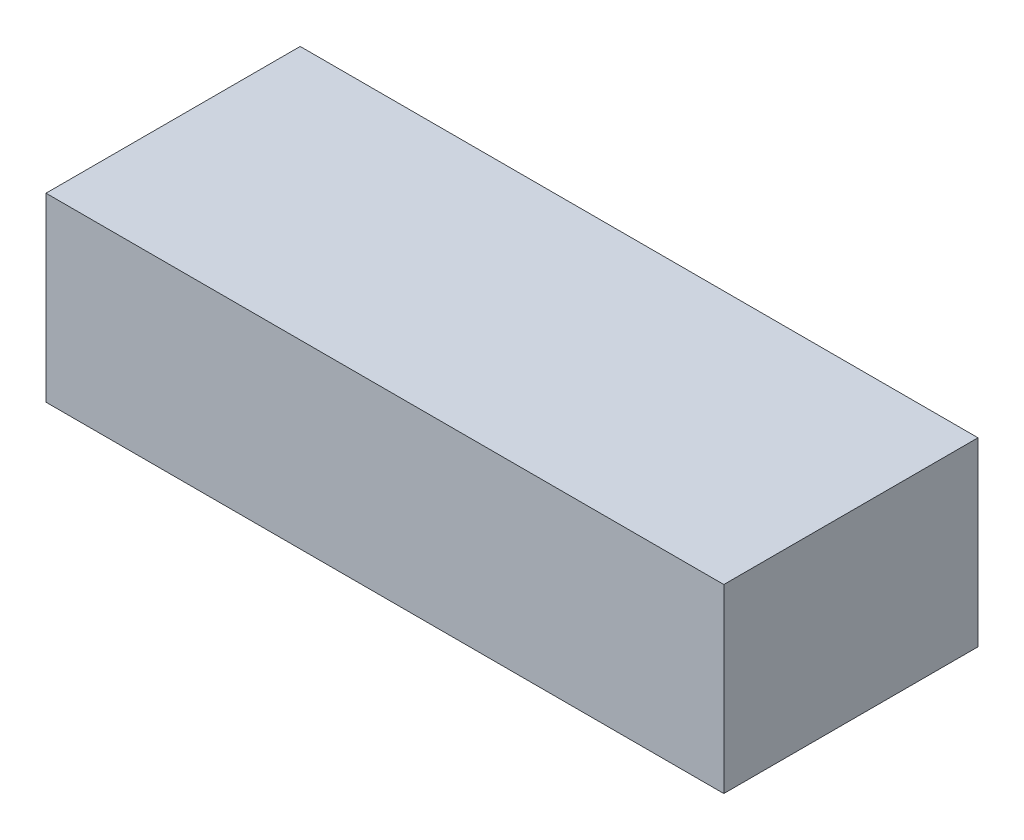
ISO-10303-21;
HEADER;
FILE_DESCRIPTION(('STEP AP214'),'2;1');
FILE_NAME('part.step','',(''),(''),'','','');
FILE_SCHEMA(('AUTOMOTIVE_DESIGN { 1 0 10303 214 1 1 1 1 }'));
ENDSEC;
DATA;
#1=APPLICATION_CONTEXT('core data for automotive mechanical design processes');
#2=APPLICATION_PROTOCOL_DEFINITION('international standard','automotive_design',2000,#1);
#3=PRODUCT_CONTEXT('',#1,'mechanical');
#4=PRODUCT('Part','Part','',(#3));
#5=PRODUCT_RELATED_PRODUCT_CATEGORY('part','',(#4));
#6=PRODUCT_DEFINITION_FORMATION('','',#4);
#7=PRODUCT_DEFINITION_CONTEXT('part definition',#1,'design');
#8=PRODUCT_DEFINITION('design','',#6,#7);
#9=PRODUCT_DEFINITION_SHAPE('','',#8);
#10=(LENGTH_UNIT() NAMED_UNIT(*) SI_UNIT(.MILLI.,.METRE.));
#11=(NAMED_UNIT(*) PLANE_ANGLE_UNIT() SI_UNIT($,.RADIAN.));
#12=(NAMED_UNIT(*) SI_UNIT($,.STERADIAN.) SOLID_ANGLE_UNIT());
#13=UNCERTAINTY_MEASURE_WITH_UNIT(LENGTH_MEASURE(1.E-05),#10,'distance_accuracy_value','');
#14=(GEOMETRIC_REPRESENTATION_CONTEXT(3) GLOBAL_UNCERTAINTY_ASSIGNED_CONTEXT((#13)) GLOBAL_UNIT_ASSIGNED_CONTEXT((#10,
#11,#12)) REPRESENTATION_CONTEXT('',''));
#15=CARTESIAN_POINT('',(0.,0.,0.));
#16=DIRECTION('',(0.,0.,1.));
#17=DIRECTION('',(1.,0.,0.));
#18=AXIS2_PLACEMENT_3D('',#15,#16,#17);
#19=CARTESIAN_POINT('',(-200.,-53.41880342,75.));
#20=DIRECTION('',(1.,0.,0.));
#21=DIRECTION('',(0.,0.,-1.));
#22=AXIS2_PLACEMENT_3D('',#19,#20,#21);
#23=PLANE('',#22);
#24=DIRECTION('',(0.,-1.,0.));
#25=VECTOR('',#24,1.);
#26=CARTESIAN_POINT('',(-200.,-53.41880342,-75.));
#27=LINE('',#26,#25);
#28=CARTESIAN_POINT('',(-200.,53.41880342,-75.));
#29=VERTEX_POINT('',#28);
#30=CARTESIAN_POINT('',(-200.,-53.41880342,-75.));
#31=VERTEX_POINT('',#30);
#32=EDGE_CURVE('E97',#29,#31,#27,.T.);
#33=ORIENTED_EDGE('',*,*,#32,.T.);
#34=DIRECTION('',(0.,0.,-1.));
#35=VECTOR('',#34,1.);
#36=CARTESIAN_POINT('',(-200.,-53.41880342,75.));
#37=LINE('',#36,#35);
#38=CARTESIAN_POINT('',(-200.,-53.41880342,75.));
#39=VERTEX_POINT('',#38);
#40=EDGE_CURVE('E11',#39,#31,#37,.T.);
#41=ORIENTED_EDGE('',*,*,#40,.F.);
#42=DIRECTION('',(0.,-1.,0.));
#43=VECTOR('',#42,1.);
#44=CARTESIAN_POINT('',(-200.,-53.41880342,75.));
#45=LINE('',#44,#43);
#46=CARTESIAN_POINT('',(-200.,53.41880342,75.));
#47=VERTEX_POINT('',#46);
#48=EDGE_CURVE('E85',#47,#39,#45,.T.);
#49=ORIENTED_EDGE('',*,*,#48,.F.);
#50=DIRECTION('',(0.,0.,-1.));
#51=VECTOR('',#50,1.);
#52=CARTESIAN_POINT('',(-200.,53.41880342,75.));
#53=LINE('',#52,#51);
#54=EDGE_CURVE('E93',#47,#29,#53,.T.);
#55=ORIENTED_EDGE('',*,*,#54,.T.);
#56=EDGE_LOOP('',(#33,#41,#49,#55));
#57=FACE_BOUND('',#56,.T.);
#58=ADVANCED_FACE('F34',(#57),#23,.F.);
#59=CARTESIAN_POINT('',(200.,-53.41880342,75.));
#60=DIRECTION('',(0.,1.,0.));
#61=DIRECTION('',(-1.,0.,0.));
#62=AXIS2_PLACEMENT_3D('',#59,#60,#61);
#63=PLANE('',#62);
#64=DIRECTION('',(1.,0.,0.));
#65=VECTOR('',#64,1.);
#66=CARTESIAN_POINT('',(200.,-53.41880342,-75.));
#67=LINE('',#66,#65);
#68=CARTESIAN_POINT('',(200.,-53.41880342,-75.));
#69=VERTEX_POINT('',#68);
#70=EDGE_CURVE('E89',#31,#69,#67,.T.);
#71=ORIENTED_EDGE('',*,*,#70,.T.);
#72=DIRECTION('',(0.,0.,-1.));
#73=VECTOR('',#72,1.);
#74=CARTESIAN_POINT('',(200.,-53.41880342,75.));
#75=LINE('',#74,#73);
#76=CARTESIAN_POINT('',(200.,-53.41880342,75.));
#77=VERTEX_POINT('',#76);
#78=EDGE_CURVE('E42',#77,#69,#75,.T.);
#79=ORIENTED_EDGE('',*,*,#78,.F.);
#80=DIRECTION('',(1.,0.,0.));
#81=VECTOR('',#80,1.);
#82=CARTESIAN_POINT('',(200.,-53.41880342,75.));
#83=LINE('',#82,#81);
#84=EDGE_CURVE('E80',#39,#77,#83,.T.);
#85=ORIENTED_EDGE('',*,*,#84,.F.);
#86=ORIENTED_EDGE('',*,*,#40,.T.);
#87=EDGE_LOOP('',(#71,#79,#85,#86));
#88=FACE_BOUND('',#87,.T.);
#89=ADVANCED_FACE('F88',(#88),#63,.F.);
#90=CARTESIAN_POINT('',(200.,-53.41880342,75.));
#91=DIRECTION('',(-1.,0.,0.));
#92=DIRECTION('',(0.,0.,1.));
#93=AXIS2_PLACEMENT_3D('',#90,#91,#92);
#94=PLANE('',#93);
#95=DIRECTION('',(0.,1.,0.));
#96=VECTOR('',#95,1.);
#97=CARTESIAN_POINT('',(200.,-53.41880342,-75.));
#98=LINE('',#97,#96);
#99=CARTESIAN_POINT('',(200.,53.41880342,-75.));
#100=VERTEX_POINT('',#99);
#101=EDGE_CURVE('E67',#69,#100,#98,.T.);
#102=ORIENTED_EDGE('',*,*,#101,.T.);
#103=DIRECTION('',(0.,0.,-1.));
#104=VECTOR('',#103,1.);
#105=CARTESIAN_POINT('',(200.,53.41880342,75.));
#106=LINE('',#105,#104);
#107=CARTESIAN_POINT('',(200.,53.41880342,75.));
#108=VERTEX_POINT('',#107);
#109=EDGE_CURVE('E90',#108,#100,#106,.T.);
#110=ORIENTED_EDGE('',*,*,#109,.F.);
#111=DIRECTION('',(0.,1.,0.));
#112=VECTOR('',#111,1.);
#113=CARTESIAN_POINT('',(200.,-53.41880342,75.));
#114=LINE('',#113,#112);
#115=EDGE_CURVE('E83',#77,#108,#114,.T.);
#116=ORIENTED_EDGE('',*,*,#115,.F.);
#117=ORIENTED_EDGE('',*,*,#78,.T.);
#118=EDGE_LOOP('',(#102,#110,#116,#117));
#119=FACE_BOUND('',#118,.T.);
#120=ADVANCED_FACE('F91',(#119),#94,.F.);
#121=CARTESIAN_POINT('',(200.,53.41880342,75.));
#122=DIRECTION('',(0.,-1.,0.));
#123=DIRECTION('',(1.,0.,0.));
#124=AXIS2_PLACEMENT_3D('',#121,#122,#123);
#125=PLANE('',#124);
#126=DIRECTION('',(-1.,0.,0.));
#127=VECTOR('',#126,1.);
#128=CARTESIAN_POINT('',(200.,53.41880342,-75.));
#129=LINE('',#128,#127);
#130=EDGE_CURVE('E73',#100,#29,#129,.T.);
#131=ORIENTED_EDGE('',*,*,#130,.T.);
#132=ORIENTED_EDGE('',*,*,#54,.F.);
#133=DIRECTION('',(-1.,0.,0.));
#134=VECTOR('',#133,1.);
#135=CARTESIAN_POINT('',(200.,53.41880342,75.));
#136=LINE('',#135,#134);
#137=EDGE_CURVE('E50',#108,#47,#136,.T.);
#138=ORIENTED_EDGE('',*,*,#137,.F.);
#139=ORIENTED_EDGE('',*,*,#109,.T.);
#140=EDGE_LOOP('',(#131,#132,#138,#139));
#141=FACE_BOUND('',#140,.T.);
#142=ADVANCED_FACE('F104',(#141),#125,.F.);
#143=CARTESIAN_POINT('',(0.,0.,75.));
#144=DIRECTION('',(0.,0.,1.));
#145=DIRECTION('',(1.,0.,0.));
#146=AXIS2_PLACEMENT_3D('',#143,#144,#145);
#147=PLANE('',#146);
#148=ORIENTED_EDGE('',*,*,#48,.T.);
#149=ORIENTED_EDGE('',*,*,#84,.T.);
#150=ORIENTED_EDGE('',*,*,#115,.T.);
#151=ORIENTED_EDGE('',*,*,#137,.T.);
#152=EDGE_LOOP('',(#148,#149,#150,#151));
#153=FACE_BOUND('',#152,.T.);
#154=ADVANCED_FACE('F81',(#153),#147,.T.);
#155=CARTESIAN_POINT('',(0.,0.,-75.));
#156=DIRECTION('',(0.,0.,1.));
#157=DIRECTION('',(1.,0.,0.));
#158=AXIS2_PLACEMENT_3D('',#155,#156,#157);
#159=PLANE('',#158);
#160=ORIENTED_EDGE('',*,*,#32,.F.);
#161=ORIENTED_EDGE('',*,*,#130,.F.);
#162=ORIENTED_EDGE('',*,*,#101,.F.);
#163=ORIENTED_EDGE('',*,*,#70,.F.);
#164=EDGE_LOOP('',(#160,#161,#162,#163));
#165=FACE_BOUND('',#164,.T.);
#166=ADVANCED_FACE('F107',(#165),#159,.F.);
#167=CLOSED_SHELL('',(#58,#89,#120,#142,#154,#166));
#168=MANIFOLD_SOLID_BREP('B2',#167);
#169=ADVANCED_BREP_SHAPE_REPRESENTATION('',(#18,#168),#14);
#170=SHAPE_DEFINITION_REPRESENTATION(#9,#169);
ENDSEC;
END-ISO-10303-21;
